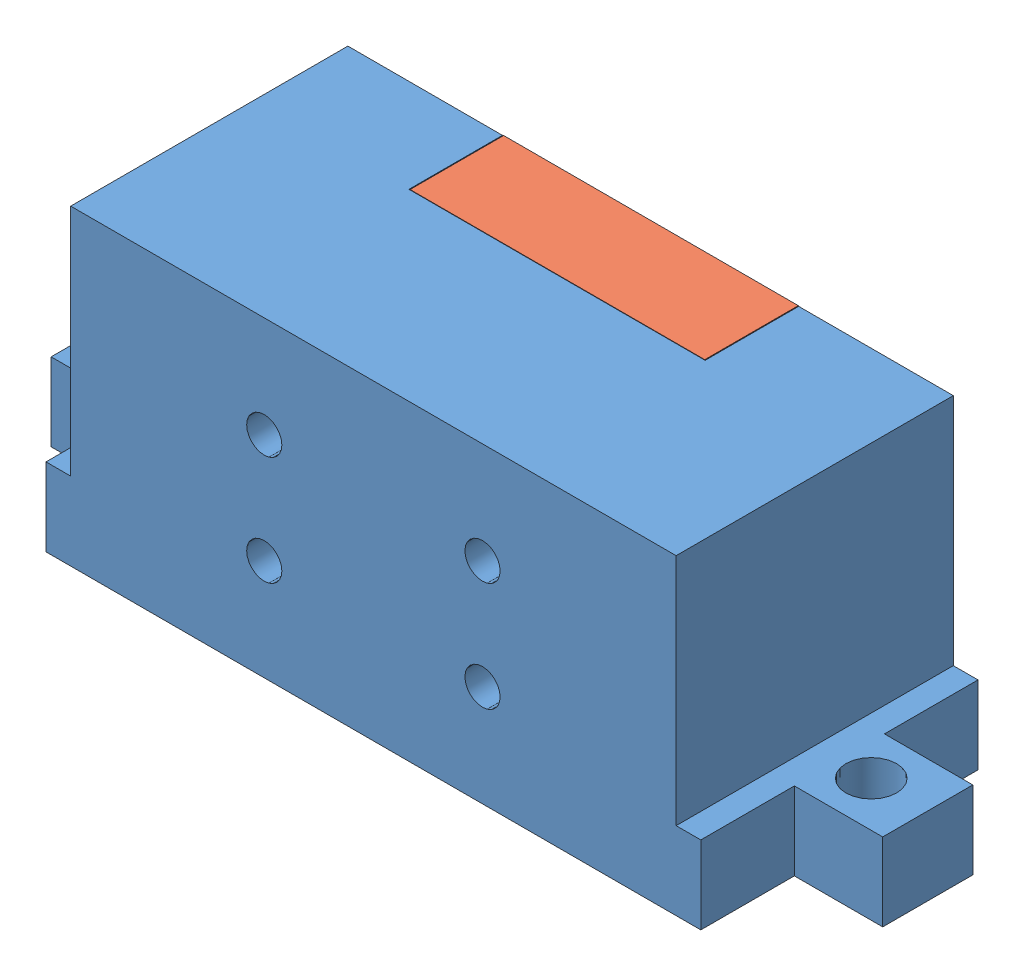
SolidWorks assembly Assem1.sldasm, configuration Default (file format 9000). Lengths in mm.
Overall size (53.34 20 17.81).
2 component instances, 2 part files, 0 mates.
Components (placement in the parent):
- Icetong01_Base-1: Icetong01_Base.SLDPRT [Default] at (-10.3551 15.5891 53.2566) size (53.34 20 17.78)
- Icetong01_Tab-1: Icetong01_Tab.SLDPRT [Default] at (6.8658 15.5912 35.4509) size (18.9 20 6)
